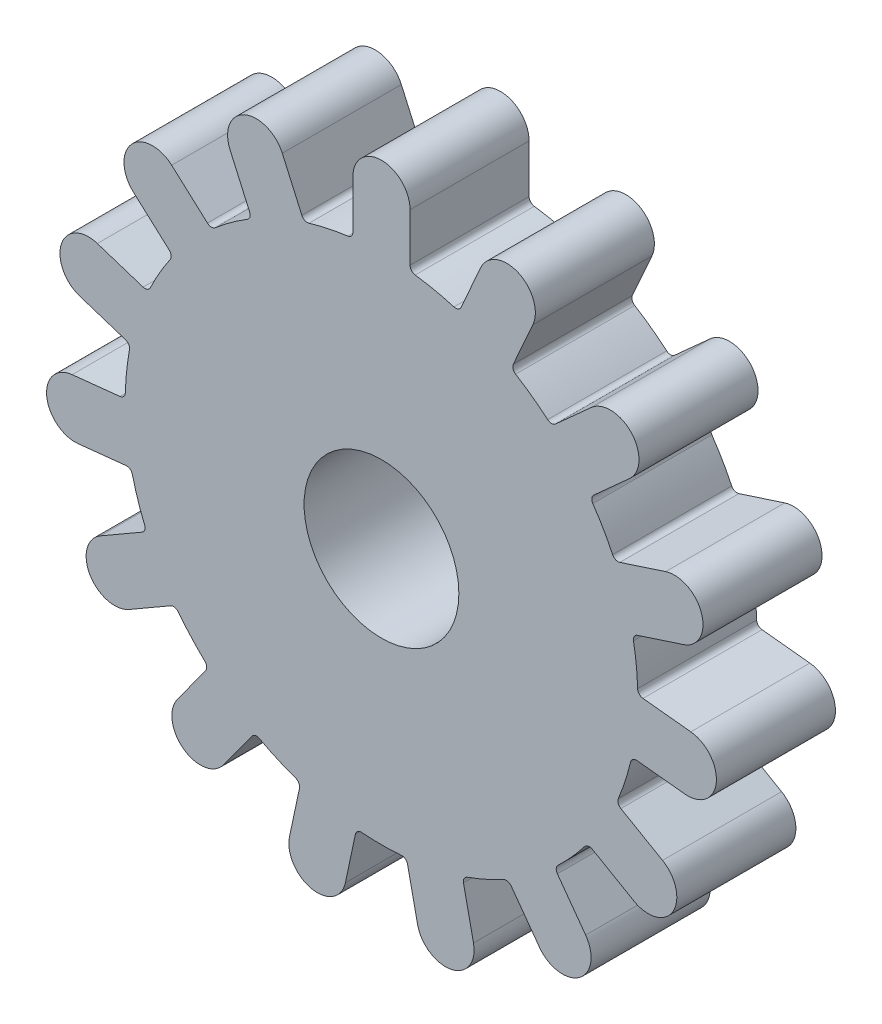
from build123d import *

# Parameters (mm, degrees)
SKETCH1_R           = 6.5
BOSS_EXTRUDE1_DEPTH = 10


with BuildPart() as part:
    # Sketch1 → Boss-Extrude1 (new body)
    with BuildSketch(Plane.XY):
        with BuildLine():
            Line((-2.4, 25.875), (-2.4, 21.833245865))
            ThreePointArc((-2.4, 21.833245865), (-2.523890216, 21.503789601), (-2.834165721, 21.337598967))
            ThreePointArc((-2.834165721, 21.337598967), (-4.475299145, 21.054627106), (-6.089644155, 20.645625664))
            ThreePointArc((-6.089644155, 20.645625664), (-6.440690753, 20.671247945), (-6.687872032, 20.921830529))
            Line((-6.687872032, 20.921830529), (-8.331801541, 24.61415666))
            ThreePointArc((-8.331801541, 24.61415666), (-11.500478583, 25.830497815), (-12.716819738, 22.661820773))
            Line((-12.716819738, 22.661820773), (-11.072890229, 18.969494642))
            ThreePointArc((-11.072890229, 18.969494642), (-11.052067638, 18.618130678), (-11.267922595, 18.340107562))
            ThreePointArc((-11.267922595, 18.340107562), (-12.652077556, 17.414090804), (-13.960499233, 16.383836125))
            ThreePointArc((-13.960499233, 16.383836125), (-14.291617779, 16.264459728), (-14.619350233, 16.392840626))
            Line((-14.619350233, 16.392840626), (-17.622958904, 19.097302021))
            ThreePointArc((-17.622958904, 19.097302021), (-21.01241994, 18.919667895), (-20.834785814, 15.530206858))
            Line((-20.834785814, 15.530206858), (-17.831177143, 12.825745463))
            ThreePointArc((-17.831177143, 12.825745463), (-17.66924216, 12.51322782), (-17.753353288, 12.171444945))
            ThreePointArc((-17.753353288, 12.171444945), (-18.641196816, 10.7625), (-19.417457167, 9.289132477))
            ThreePointArc((-19.417457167, 9.289132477), (-19.671394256, 9.045398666), (-20.023009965, 9.029379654))
            Line((-20.023009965, 9.029379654), (-23.866946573, 10.278350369))
            ThreePointArc((-23.866946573, 10.278350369), (-26.891122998, 8.737455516), (-25.350228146, 5.71327909))
            Line((-25.350228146, 5.71327909), (-21.506291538, 4.464308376))
            ThreePointArc((-21.506291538, 4.464308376), (-21.231244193, 4.244674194), (-21.169067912, 3.898228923))
            ThreePointArc((-21.169067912, 3.898228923), (-21.407083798, 2.249975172), (-21.516960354, 0.588253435))
            ThreePointArc((-21.516960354, 0.588253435), (-21.649807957, 0.262306), (-21.964509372, 0.10465691))
            Line((-21.964509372, 0.10465691), (-25.984122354, -0.317821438))
            ThreePointArc((-25.984122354, -0.317821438), (-28.120106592, -2.955542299), (-25.482385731, -5.091526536))
            Line((-25.482385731, -5.091526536), (-21.462772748, -4.669048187))
            ThreePointArc((-21.462772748, -4.669048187), (-21.122171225, -4.757822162), (-20.92445838, -5.049026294))
            ThreePointArc((-20.92445838, -5.049026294), (-20.471491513, -6.651590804), (-19.895985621, -8.214339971))
            ThreePointArc((-19.895985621, -8.214339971), (-19.88477318, -8.566141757), (-20.108145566, -8.838161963))
            Line((-20.108145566, -8.838161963), (-23.608407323, -10.859039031))
            ThreePointArc((-23.608407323, -10.859039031), (-24.486868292, -14.1375), (-21.208407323, -15.015960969))
            Line((-21.208407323, -15.015960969), (-17.708145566, -12.995083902))
            ThreePointArc((-17.708145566, -12.995083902), (-17.360882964, -12.937647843), (-17.061819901, -13.123258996))
            ThreePointArc((-17.061819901, -13.123258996), (-15.996192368, -14.403036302), (-14.834814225, -15.59659937))
            ThreePointArc((-14.834814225, -15.59659937), (-14.681480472, -15.913425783), (-14.774900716, -16.252782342))
            Line((-14.774900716, -16.252782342), (-17.15058419, -19.522630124))
            ThreePointArc((-17.15058419, -19.522630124), (-16.619628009, -22.874955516), (-13.267302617, -22.343999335))
            Line((-13.267302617, -22.343999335), (-10.891619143, -19.074151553))
            ThreePointArc((-10.891619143, -19.074151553), (-10.597740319, -18.880436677), (-10.249037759, -18.928360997))
            ThreePointArc((-10.249037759, -18.928360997), (-8.755006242, -19.664065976), (-7.208568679, -20.282065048))
            ThreePointArc((-7.208568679, -20.282065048), (-6.939626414, -20.509133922), (-6.886941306, -20.857149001))
            Line((-6.886941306, -20.857149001), (-7.727269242, -24.810581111))
            ThreePointArc((-7.727269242, -24.810581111), (-5.878703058, -27.657123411), (-3.032160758, -25.808557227))
            Line((-3.032160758, -25.808557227), (-2.191832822, -21.855125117))
            ThreePointArc((-2.191832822, -21.855125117), (-2.002152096, -21.558626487), (-1.664103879, -21.460577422))
            ThreePointArc((-1.664103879, -21.460577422), (0, -21.525), (1.664103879, -21.460577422))
            ThreePointArc((1.664103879, -21.460577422), (2.002152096, -21.558626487), (2.191832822, -21.855125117))
            Line((2.191832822, -21.855125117), (3.032160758, -25.808557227))
            ThreePointArc((3.032160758, -25.808557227), (5.878703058, -27.657123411), (7.727269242, -24.810581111))
            Line((7.727269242, -24.810581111), (6.886941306, -20.857149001))
            ThreePointArc((6.886941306, -20.857149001), (6.939626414, -20.509133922), (7.208568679, -20.282065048))
            ThreePointArc((7.208568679, -20.282065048), (8.755006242, -19.664065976), (10.249037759, -18.928360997))
            ThreePointArc((10.249037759, -18.928360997), (10.597740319, -18.880436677), (10.891619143, -19.074151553))
            Line((10.891619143, -19.074151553), (13.267302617, -22.343999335))
            ThreePointArc((13.267302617, -22.343999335), (16.619628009, -22.874955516), (17.15058419, -19.522630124))
            Line((17.15058419, -19.522630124), (14.774900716, -16.252782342))
            ThreePointArc((14.774900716, -16.252782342), (14.681480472, -15.913425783), (14.834814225, -15.59659937))
            ThreePointArc((14.834814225, -15.59659937), (15.996192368, -14.403036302), (17.061819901, -13.123258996))
            ThreePointArc((17.061819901, -13.123258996), (17.360882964, -12.937647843), (17.708145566, -12.995083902))
            Line((17.708145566, -12.995083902), (21.208407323, -15.015960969))
            ThreePointArc((21.208407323, -15.015960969), (24.486868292, -14.1375), (23.608407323, -10.859039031))
            Line((23.608407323, -10.859039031), (20.108145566, -8.838161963))
            ThreePointArc((20.108145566, -8.838161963), (19.88477318, -8.566141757), (19.895985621, -8.214339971))
            ThreePointArc((19.895985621, -8.214339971), (20.471491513, -6.651590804), (20.92445838, -5.049026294))
            ThreePointArc((20.92445838, -5.049026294), (21.122171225, -4.757822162), (21.462772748, -4.669048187))
            Line((21.462772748, -4.669048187), (25.482385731, -5.091526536))
            ThreePointArc((25.482385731, -5.091526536), (28.120106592, -2.955542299), (25.984122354, -0.317821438))
            Line((25.984122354, -0.317821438), (21.964509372, 0.10465691))
            ThreePointArc((21.964509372, 0.10465691), (21.649807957, 0.262306), (21.516960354, 0.588253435))
            ThreePointArc((21.516960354, 0.588253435), (21.407083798, 2.249975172), (21.169067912, 3.898228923))
            ThreePointArc((21.169067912, 3.898228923), (21.231244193, 4.244674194), (21.506291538, 4.464308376))
            Line((21.506291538, 4.464308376), (25.350228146, 5.71327909))
            ThreePointArc((25.350228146, 5.71327909), (26.891122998, 8.737455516), (23.866946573, 10.278350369))
            Line((23.866946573, 10.278350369), (20.023009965, 9.029379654))
            ThreePointArc((20.023009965, 9.029379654), (19.671394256, 9.045398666), (19.417457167, 9.289132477))
            ThreePointArc((19.417457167, 9.289132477), (18.641196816, 10.7625), (17.753353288, 12.171444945))
            ThreePointArc((17.753353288, 12.171444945), (17.66924216, 12.51322782), (17.831177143, 12.825745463))
            Line((17.831177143, 12.825745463), (20.834785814, 15.530206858))
            ThreePointArc((20.834785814, 15.530206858), (21.01241994, 18.919667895), (17.622958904, 19.097302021))
            Line((17.622958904, 19.097302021), (14.619350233, 16.392840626))
            ThreePointArc((14.619350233, 16.392840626), (14.291617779, 16.264459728), (13.960499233, 16.383836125))
            ThreePointArc((13.960499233, 16.383836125), (12.652077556, 17.414090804), (11.267922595, 18.340107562))
            ThreePointArc((11.267922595, 18.340107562), (11.052067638, 18.618130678), (11.072890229, 18.969494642))
            Line((11.072890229, 18.969494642), (12.716819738, 22.661820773))
            ThreePointArc((12.716819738, 22.661820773), (11.500478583, 25.830497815), (8.331801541, 24.61415666))
            Line((8.331801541, 24.61415666), (6.687872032, 20.921830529))
            ThreePointArc((6.687872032, 20.921830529), (6.440690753, 20.671247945), (6.089644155, 20.645625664))
            ThreePointArc((6.089644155, 20.645625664), (4.475299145, 21.054627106), (2.834165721, 21.337598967))
            ThreePointArc((2.834165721, 21.337598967), (2.523890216, 21.503789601), (2.4, 21.833245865))
            Line((2.4, 21.833245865), (2.4, 25.875))
            ThreePointArc((2.4, 25.875), (0, 28.275), (-2.4, 25.875))
        make_face()
        Circle(SKETCH1_R, mode=Mode.SUBTRACT)
    extrude(amount=BOSS_EXTRUDE1_DEPTH)


solid = part.part
